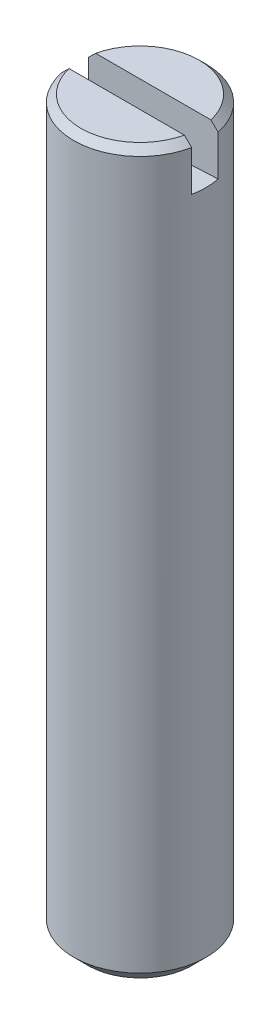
ISO-10303-21;
HEADER;
FILE_DESCRIPTION(('STEP AP214'),'2;1');
FILE_NAME('part.step','',(''),(''),'','','');
FILE_SCHEMA(('AUTOMOTIVE_DESIGN { 1 0 10303 214 1 1 1 1 }'));
ENDSEC;
DATA;
#1=APPLICATION_CONTEXT('core data for automotive mechanical design processes');
#2=APPLICATION_PROTOCOL_DEFINITION('international standard','automotive_design',2000,#1);
#3=PRODUCT_CONTEXT('',#1,'mechanical');
#4=PRODUCT('Part','Part','',(#3));
#5=PRODUCT_RELATED_PRODUCT_CATEGORY('part','',(#4));
#6=PRODUCT_DEFINITION_FORMATION('','',#4);
#7=PRODUCT_DEFINITION_CONTEXT('part definition',#1,'design');
#8=PRODUCT_DEFINITION('design','',#6,#7);
#9=PRODUCT_DEFINITION_SHAPE('','',#8);
#10=(LENGTH_UNIT() NAMED_UNIT(*) SI_UNIT(.MILLI.,.METRE.));
#11=(NAMED_UNIT(*) PLANE_ANGLE_UNIT() SI_UNIT($,.RADIAN.));
#12=(NAMED_UNIT(*) SI_UNIT($,.STERADIAN.) SOLID_ANGLE_UNIT());
#13=UNCERTAINTY_MEASURE_WITH_UNIT(LENGTH_MEASURE(1.E-05),#10,'distance_accuracy_value','');
#14=(GEOMETRIC_REPRESENTATION_CONTEXT(3) GLOBAL_UNCERTAINTY_ASSIGNED_CONTEXT((#13)) GLOBAL_UNIT_ASSIGNED_CONTEXT((#10,
#11,#12)) REPRESENTATION_CONTEXT('',''));
#15=CARTESIAN_POINT('',(0.,0.,0.));
#16=DIRECTION('',(0.,0.,1.));
#17=DIRECTION('',(1.,0.,0.));
#18=AXIS2_PLACEMENT_3D('',#15,#16,#17);
#19=CARTESIAN_POINT('',(0.,52.,0.4));
#20=DIRECTION('',(0.,0.,-1.));
#21=DIRECTION('',(-1.,0.,0.));
#22=AXIS2_PLACEMENT_3D('',#19,#20,#21);
#23=CYLINDRICAL_SURFACE('',#22,31.5);
#24=CARTESIAN_POINT('',(1.95959179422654,20.5610114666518,-0.4));
#25=CARTESIAN_POINT('',(1.97091486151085,20.5617184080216,-0.344561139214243));
#26=CARTESIAN_POINT('',(1.97987306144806,20.562281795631,-0.288637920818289));
#27=CARTESIAN_POINT('',(1.99302430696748,20.5631121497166,-0.1762131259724));
#28=CARTESIAN_POINT('',(1.99721579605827,20.5633790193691,-0.119711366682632));
#29=CARTESIAN_POINT('',(2.0007609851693,20.5636046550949,-0.00749894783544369));
#30=CARTESIAN_POINT('',(2.00019410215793,20.5635684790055,0.0482092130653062));
#31=CARTESIAN_POINT('',(1.99441663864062,20.5632012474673,0.15936012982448));
#32=CARTESIAN_POINT('',(1.98920814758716,20.5628703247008,0.21480299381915));
#33=CARTESIAN_POINT('',(1.97576492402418,20.562023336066,0.313516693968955));
#34=CARTESIAN_POINT('',(1.96839158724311,20.561560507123,0.356906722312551));
#35=CARTESIAN_POINT('',(1.95959179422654,20.5610114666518,0.4));
#36=B_SPLINE_CURVE_WITH_KNOTS('',3,(#24,#25,#26,#27,#28,#29,#30,#31,#32,#33,#34,#35),
.UNSPECIFIED.,.F.,.F.,(4,2,2,2,2,4),(0.,0.169712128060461,0.33947965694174,0.506419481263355,
0.673284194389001,0.805229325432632),.UNSPECIFIED.);
#37=CARTESIAN_POINT('',(1.95959179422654,20.5610114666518,-0.4));
#38=VERTEX_POINT('',#37);
#39=CARTESIAN_POINT('',(1.95959179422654,20.5610114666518,0.4));
#40=VERTEX_POINT('',#39);
#41=EDGE_CURVE('E81',#38,#40,#36,.T.);
#42=ORIENTED_EDGE('',*,*,#41,.F.);
#43=CARTESIAN_POINT('',(0.,52.,-0.4));
#44=DIRECTION('',(0.,0.,-1.));
#45=DIRECTION('',(-1.,0.,0.));
#46=AXIS2_PLACEMENT_3D('',#43,#44,#45);
#47=CIRCLE('',#46,31.5);
#48=CARTESIAN_POINT('',(-1.95959179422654,20.5610114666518,-0.4));
#49=VERTEX_POINT('',#48);
#50=EDGE_CURVE('E87',#49,#38,#47,.F.);
#51=ORIENTED_EDGE('',*,*,#50,.F.);
#52=CARTESIAN_POINT('',(-1.95959179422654,20.5610114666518,0.4));
#53=CARTESIAN_POINT('',(-1.97091486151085,20.5617184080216,0.344561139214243));
#54=CARTESIAN_POINT('',(-1.97987306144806,20.562281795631,0.28863792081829));
#55=CARTESIAN_POINT('',(-1.99302430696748,20.5631121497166,0.176213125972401));
#56=CARTESIAN_POINT('',(-1.99721579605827,20.5633790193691,0.119711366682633));
#57=CARTESIAN_POINT('',(-2.0007609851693,20.5636046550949,0.00749894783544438));
#58=CARTESIAN_POINT('',(-2.00019410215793,20.5635684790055,-0.0482092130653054));
#59=CARTESIAN_POINT('',(-1.99441663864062,20.5632012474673,-0.159360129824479));
#60=CARTESIAN_POINT('',(-1.98920814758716,20.5628703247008,-0.214802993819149));
#61=CARTESIAN_POINT('',(-1.97576492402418,20.562023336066,-0.313516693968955));
#62=CARTESIAN_POINT('',(-1.96839158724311,20.561560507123,-0.356906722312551));
#63=CARTESIAN_POINT('',(-1.95959179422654,20.5610114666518,-0.4));
#64=B_SPLINE_CURVE_WITH_KNOTS('',3,(#52,#53,#54,#55,#56,#57,#58,#59,#60,#61,#62,#63),
.UNSPECIFIED.,.F.,.F.,(4,2,2,2,2,4),(0.,0.169712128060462,0.33947965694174,0.506419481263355,
0.673284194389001,0.805229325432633),.UNSPECIFIED.);
#65=CARTESIAN_POINT('',(-1.95959179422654,20.5610114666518,0.4));
#66=VERTEX_POINT('',#65);
#67=EDGE_CURVE('E18',#66,#49,#64,.T.);
#68=ORIENTED_EDGE('',*,*,#67,.F.);
#69=CARTESIAN_POINT('',(0.,52.,0.4));
#70=DIRECTION('',(0.,0.,-1.));
#71=DIRECTION('',(-1.,0.,0.));
#72=AXIS2_PLACEMENT_3D('',#69,#70,#71);
#73=CIRCLE('',#72,31.5);
#74=EDGE_CURVE('E80',#66,#40,#73,.F.);
#75=ORIENTED_EDGE('',*,*,#74,.T.);
#76=EDGE_LOOP('',(#42,#51,#68,#75));
#77=FACE_BOUND('',#76,.T.);
#78=ADVANCED_FACE('F14',(#77),#23,.F.);
#79=CARTESIAN_POINT('',(0.,52.,0.4));
#80=DIRECTION('',(0.,0.,1.));
#81=DIRECTION('',(1.,0.,0.));
#82=AXIS2_PLACEMENT_3D('',#79,#80,#81);
#83=PLANE('',#82);
#84=DIRECTION('',(1.,0.,0.));
#85=VECTOR('',#84,1.);
#86=CARTESIAN_POINT('',(0.,22.,0.4));
#87=LINE('',#86,#85);
#88=CARTESIAN_POINT('',(-1.74011788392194,21.9999999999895,0.4));
#89=VERTEX_POINT('',#88);
#90=CARTESIAN_POINT('',(1.74011788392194,21.9999999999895,0.4));
#91=VERTEX_POINT('',#90);
#92=EDGE_CURVE('E156',#89,#91,#87,.T.);
#93=ORIENTED_EDGE('',*,*,#92,.T.);
#94=CARTESIAN_POINT('',(1.95959179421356,21.7854999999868,0.4));
#95=CARTESIAN_POINT('',(1.92306031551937,21.8212986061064,0.4));
#96=CARTESIAN_POINT('',(1.88650508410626,21.8570729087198,0.4));
#97=CARTESIAN_POINT('',(1.81334711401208,21.9285729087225,0.4));
#98=CARTESIAN_POINT('',(1.77674437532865,21.9642986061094,0.4));
#99=CARTESIAN_POINT('',(1.74011788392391,21.9999999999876,0.4));
#100=B_SPLINE_CURVE_WITH_KNOTS('',3,(#94,#95,#96,#97,#98,#99),.UNSPECIFIED.,.F.,.F.,(4,2,4),(0.,
0.153443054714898,0.306886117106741),.UNSPECIFIED.);
#101=CARTESIAN_POINT('',(1.95959179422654,21.785499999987,0.4));
#102=VERTEX_POINT('',#101);
#103=EDGE_CURVE('E94',#102,#91,#100,.T.);
#104=ORIENTED_EDGE('',*,*,#103,.F.);
#105=DIRECTION('',(0.,1.,0.));
#106=VECTOR('',#105,1.);
#107=CARTESIAN_POINT('',(1.95959179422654,52.,0.4));
#108=LINE('',#107,#106);
#109=EDGE_CURVE('E92',#40,#102,#108,.T.);
#110=ORIENTED_EDGE('',*,*,#109,.F.);
#111=ORIENTED_EDGE('',*,*,#74,.F.);
#112=DIRECTION('',(0.,1.,0.));
#113=VECTOR('',#112,1.);
#114=CARTESIAN_POINT('',(-1.95959179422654,52.,0.4));
#115=LINE('',#114,#113);
#116=CARTESIAN_POINT('',(-1.95959179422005,21.7854999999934,0.4));
#117=VERTEX_POINT('',#116);
#118=EDGE_CURVE('E72',#117,#66,#115,.F.);
#119=ORIENTED_EDGE('',*,*,#118,.F.);
#120=CARTESIAN_POINT('',(-1.74011788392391,21.9999999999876,0.4));
#121=CARTESIAN_POINT('',(-1.77674437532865,21.9642986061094,0.4));
#122=CARTESIAN_POINT('',(-1.81334711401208,21.9285729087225,0.4));
#123=CARTESIAN_POINT('',(-1.88650508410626,21.8570729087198,0.4));
#124=CARTESIAN_POINT('',(-1.92306031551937,21.8212986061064,0.4));
#125=CARTESIAN_POINT('',(-1.95959179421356,21.7854999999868,0.4));
#126=B_SPLINE_CURVE_WITH_KNOTS('',3,(#120,#121,#122,#123,#124,#125),.UNSPECIFIED.,.F.,.F.,(4,2,
4),(0.,0.153443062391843,0.306886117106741),.UNSPECIFIED.);
#127=EDGE_CURVE('E144',#89,#117,#126,.T.);
#128=ORIENTED_EDGE('',*,*,#127,.F.);
#129=EDGE_LOOP('',(#93,#104,#110,#111,#119,#128));
#130=FACE_BOUND('',#129,.T.);
#131=ADVANCED_FACE('F90',(#130),#83,.F.);
#132=CARTESIAN_POINT('',(0.,52.,-0.4));
#133=DIRECTION('',(0.,0.,1.));
#134=DIRECTION('',(1.,0.,0.));
#135=AXIS2_PLACEMENT_3D('',#132,#133,#134);
#136=PLANE('',#135);
#137=DIRECTION('',(1.,0.,0.));
#138=VECTOR('',#137,1.);
#139=CARTESIAN_POINT('',(0.,22.,-0.4));
#140=LINE('',#139,#138);
#141=CARTESIAN_POINT('',(1.74011788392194,21.9999999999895,-0.4));
#142=VERTEX_POINT('',#141);
#143=CARTESIAN_POINT('',(-1.74011788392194,21.9999999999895,-0.4));
#144=VERTEX_POINT('',#143);
#145=EDGE_CURVE('E158',#142,#144,#140,.F.);
#146=ORIENTED_EDGE('',*,*,#145,.T.);
#147=CARTESIAN_POINT('',(-1.74011788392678,21.9999999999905,-0.400000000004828));
#148=CARTESIAN_POINT('',(-1.77674437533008,21.9642986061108,-0.400000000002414));
#149=CARTESIAN_POINT('',(-1.81334711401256,21.9285729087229,-0.400000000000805));
#150=CARTESIAN_POINT('',(-1.88650508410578,21.8570729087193,-0.399999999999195));
#151=CARTESIAN_POINT('',(-1.9230603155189,21.8212986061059,-0.399999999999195));
#152=CARTESIAN_POINT('',(-1.95959179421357,21.7854999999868,-0.4));
#153=B_SPLINE_CURVE_WITH_KNOTS('',3,(#147,#148,#149,#150,#151,#152),.UNSPECIFIED.,.F.,.F.,(4,2,
4),(0.,0.153443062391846,0.306886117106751),.UNSPECIFIED.);
#154=CARTESIAN_POINT('',(-1.95959179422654,21.785499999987,-0.4));
#155=VERTEX_POINT('',#154);
#156=EDGE_CURVE('E38',#144,#155,#153,.T.);
#157=ORIENTED_EDGE('',*,*,#156,.T.);
#158=DIRECTION('',(0.,1.,0.));
#159=VECTOR('',#158,1.);
#160=CARTESIAN_POINT('',(-1.95959179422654,52.,-0.4));
#161=LINE('',#160,#159);
#162=EDGE_CURVE('E149',#155,#49,#161,.F.);
#163=ORIENTED_EDGE('',*,*,#162,.T.);
#164=ORIENTED_EDGE('',*,*,#50,.T.);
#165=DIRECTION('',(0.,1.,0.));
#166=VECTOR('',#165,1.);
#167=CARTESIAN_POINT('',(1.95959179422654,52.,-0.4));
#168=LINE('',#167,#166);
#169=CARTESIAN_POINT('',(1.95959179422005,21.7854999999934,-0.4));
#170=VERTEX_POINT('',#169);
#171=EDGE_CURVE('E132',#38,#170,#168,.T.);
#172=ORIENTED_EDGE('',*,*,#171,.T.);
#173=CARTESIAN_POINT('',(1.95959179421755,21.7854999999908,-0.40000000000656));
#174=CARTESIAN_POINT('',(1.92306031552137,21.8212986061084,-0.40000000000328));
#175=CARTESIAN_POINT('',(1.88650508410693,21.8570729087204,-0.400000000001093));
#176=CARTESIAN_POINT('',(1.81334711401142,21.9285729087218,-0.399999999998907));
#177=CARTESIAN_POINT('',(1.77674437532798,21.9642986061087,-0.399999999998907));
#178=CARTESIAN_POINT('',(1.7401178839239,21.9999999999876,-0.4));
#179=B_SPLINE_CURVE_WITH_KNOTS('',3,(#173,#174,#175,#176,#177,#178),.UNSPECIFIED.,.F.,.F.,(4,2,
4),(0.,0.153443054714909,0.306886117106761),.UNSPECIFIED.);
#180=EDGE_CURVE('E126',#170,#142,#179,.T.);
#181=ORIENTED_EDGE('',*,*,#180,.T.);
#182=EDGE_LOOP('',(#146,#157,#163,#164,#172,#181));
#183=FACE_BOUND('',#182,.T.);
#184=ADVANCED_FACE('F133',(#183),#136,.T.);
#185=CARTESIAN_POINT('',(1.5705,0.,0.));
#186=DIRECTION('',(0.,1.,0.));
#187=DIRECTION('',(0.,0.,1.));
#188=AXIS2_PLACEMENT_3D('',#185,#186,#187);
#189=PLANE('',#188);
#190=CARTESIAN_POINT('',(0.,-5.6843418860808E-11,0.));
#191=DIRECTION('',(0.,1.,0.));
#192=DIRECTION('',(-1.,0.,0.));
#193=AXIS2_PLACEMENT_3D('',#190,#191,#192);
#194=CIRCLE('',#193,1.57050000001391);
#195=CARTESIAN_POINT('',(-1.57050000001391,-5.68433975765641E-11,0.));
#196=VERTEX_POINT('',#195);
#197=EDGE_CURVE('E162',#196,#196,#194,.T.);
#198=ORIENTED_EDGE('',*,*,#197,.F.);
#199=EDGE_LOOP('',(#198));
#200=FACE_BOUND('',#199,.T.);
#201=ADVANCED_FACE('F137',(#200),#189,.F.);
#202=CARTESIAN_POINT('',(0.,22.,0.));
#203=DIRECTION('',(0.,-1.,0.));
#204=DIRECTION('',(0.,0.,-1.));
#205=AXIS2_PLACEMENT_3D('',#202,#203,#204);
#206=PLANE('',#205);
#207=ORIENTED_EDGE('',*,*,#92,.F.);
#208=CARTESIAN_POINT('',(0.,21.9999999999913,0.));
#209=DIRECTION('',(0.,-1.,0.));
#210=DIRECTION('',(0.,0.,-1.));
#211=AXIS2_PLACEMENT_3D('',#208,#209,#210);
#212=CIRCLE('',#211,1.78549999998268);
#213=EDGE_CURVE('E154',#91,#89,#212,.T.);
#214=ORIENTED_EDGE('',*,*,#213,.F.);
#215=EDGE_LOOP('',(#207,#214));
#216=FACE_BOUND('',#215,.T.);
#217=ADVANCED_FACE('F160',(#216),#206,.F.);
#218=CARTESIAN_POINT('',(0.,22.,0.));
#219=DIRECTION('',(0.,-1.,0.));
#220=DIRECTION('',(0.,0.,-1.));
#221=AXIS2_PLACEMENT_3D('',#218,#219,#220);
#222=PLANE('',#221);
#223=CARTESIAN_POINT('',(0.,21.9999999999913,0.));
#224=DIRECTION('',(0.,-1.,0.));
#225=DIRECTION('',(0.,0.,-1.));
#226=AXIS2_PLACEMENT_3D('',#223,#224,#225);
#227=CIRCLE('',#226,1.78549999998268);
#228=EDGE_CURVE('E161',#144,#142,#227,.T.);
#229=ORIENTED_EDGE('',*,*,#228,.F.);
#230=ORIENTED_EDGE('',*,*,#145,.F.);
#231=EDGE_LOOP('',(#229,#230));
#232=FACE_BOUND('',#231,.T.);
#233=ADVANCED_FACE('F182',(#232),#222,.F.);
#234=CARTESIAN_POINT('',(0.,0.429499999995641,0.));
#235=DIRECTION('',(0.,1.,0.));
#236=DIRECTION('',(-1.,0.,0.));
#237=AXIS2_PLACEMENT_3D('',#234,#235,#236);
#238=CONICAL_SURFACE('',#237,2.00000000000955,0.785398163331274);
#239=CARTESIAN_POINT('',(0.,0.4295,0.));
#240=DIRECTION('',(0.,-1.,0.));
#241=DIRECTION('',(0.,0.,-1.));
#242=AXIS2_PLACEMENT_3D('',#239,#240,#241);
#243=CIRCLE('',#242,2.);
#244=CARTESIAN_POINT('',(0.,0.4295,-2.));
#245=VERTEX_POINT('',#244);
#246=EDGE_CURVE('E164',#245,#245,#243,.F.);
#247=ORIENTED_EDGE('',*,*,#246,.F.);
#248=EDGE_LOOP('',(#247));
#249=FACE_BOUND('',#248,.T.);
#250=ORIENTED_EDGE('',*,*,#197,.T.);
#251=EDGE_LOOP('',(#250));
#252=FACE_BOUND('',#251,.T.);
#253=ADVANCED_FACE('F179',(#249,#252),#238,.T.);
#254=CARTESIAN_POINT('',(0.,21.7854999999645,0.));
#255=DIRECTION('',(0.,-1.,0.));
#256=DIRECTION('',(0.,0.,-1.));
#257=AXIS2_PLACEMENT_3D('',#254,#255,#256);
#258=CONICAL_SURFACE('',#257,2.00000000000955,0.785398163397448);
#259=ORIENTED_EDGE('',*,*,#213,.T.);
#260=ORIENTED_EDGE('',*,*,#127,.T.);
#261=CARTESIAN_POINT('',(0.,21.7855,0.));
#262=DIRECTION('',(0.,-1.,0.));
#263=DIRECTION('',(0.,0.,-1.));
#264=AXIS2_PLACEMENT_3D('',#261,#262,#263);
#265=CIRCLE('',#264,2.);
#266=EDGE_CURVE('E29',#102,#117,#265,.T.);
#267=ORIENTED_EDGE('',*,*,#266,.F.);
#268=ORIENTED_EDGE('',*,*,#103,.T.);
#269=EDGE_LOOP('',(#259,#260,#267,#268));
#270=FACE_BOUND('',#269,.T.);
#271=ADVANCED_FACE('F114',(#270),#258,.T.);
#272=CARTESIAN_POINT('',(0.,21.7854999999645,0.));
#273=DIRECTION('',(0.,-1.,0.));
#274=DIRECTION('',(0.,0.,-1.));
#275=AXIS2_PLACEMENT_3D('',#272,#273,#274);
#276=CONICAL_SURFACE('',#275,2.00000000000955,0.785398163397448);
#277=ORIENTED_EDGE('',*,*,#156,.F.);
#278=ORIENTED_EDGE('',*,*,#228,.T.);
#279=ORIENTED_EDGE('',*,*,#180,.F.);
#280=CARTESIAN_POINT('',(0.,21.7855,0.));
#281=DIRECTION('',(0.,-1.,0.));
#282=DIRECTION('',(0.,0.,-1.));
#283=AXIS2_PLACEMENT_3D('',#280,#281,#282);
#284=CIRCLE('',#283,2.);
#285=EDGE_CURVE('E9',#155,#170,#284,.T.);
#286=ORIENTED_EDGE('',*,*,#285,.F.);
#287=EDGE_LOOP('',(#277,#278,#279,#286));
#288=FACE_BOUND('',#287,.T.);
#289=ADVANCED_FACE('F110',(#288),#276,.T.);
#290=CARTESIAN_POINT('',(0.,15.,0.));
#291=DIRECTION('',(0.,-1.,0.));
#292=DIRECTION('',(0.,0.,-1.));
#293=AXIS2_PLACEMENT_3D('',#290,#291,#292);
#294=CYLINDRICAL_SURFACE('',#293,2.);
#295=ORIENTED_EDGE('',*,*,#41,.T.);
#296=ORIENTED_EDGE('',*,*,#109,.T.);
#297=ORIENTED_EDGE('',*,*,#266,.T.);
#298=ORIENTED_EDGE('',*,*,#118,.T.);
#299=ORIENTED_EDGE('',*,*,#67,.T.);
#300=ORIENTED_EDGE('',*,*,#162,.F.);
#301=ORIENTED_EDGE('',*,*,#285,.T.);
#302=ORIENTED_EDGE('',*,*,#171,.F.);
#303=EDGE_LOOP('',(#295,#296,#297,#298,#299,#300,#301,#302));
#304=FACE_BOUND('',#303,.T.);
#305=ORIENTED_EDGE('',*,*,#246,.T.);
#306=EDGE_LOOP('',(#305));
#307=FACE_BOUND('',#306,.T.);
#308=ADVANCED_FACE('F74',(#304,#307),#294,.T.);
#309=CLOSED_SHELL('',(#78,#131,#184,#201,#217,#233,#253,#271,#289,#308));
#310=MANIFOLD_SOLID_BREP('B1',#309);
#311=ADVANCED_BREP_SHAPE_REPRESENTATION('',(#18,#310),#14);
#312=SHAPE_DEFINITION_REPRESENTATION(#9,#311);
ENDSEC;
END-ISO-10303-21;
